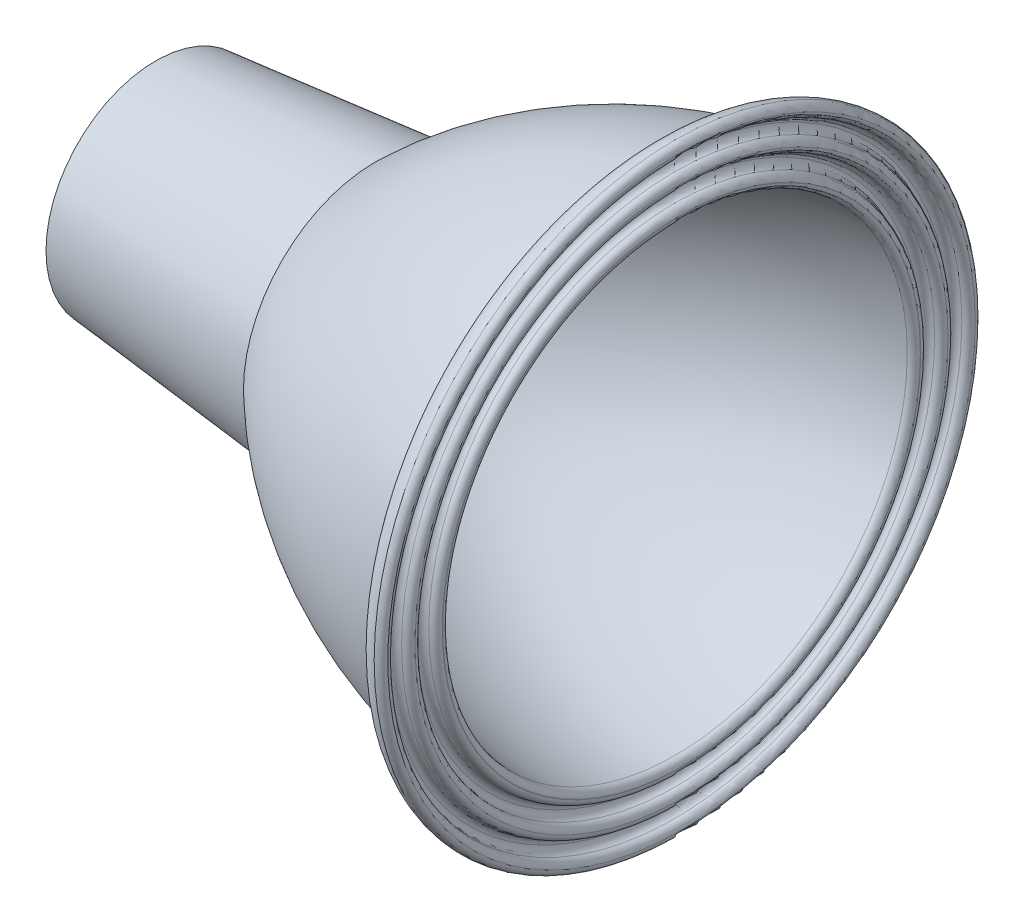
ISO-10303-21;
HEADER;
FILE_DESCRIPTION(('STEP AP214'),'2;1');
FILE_NAME('part.step','',(''),(''),'','','');
FILE_SCHEMA(('AUTOMOTIVE_DESIGN { 1 0 10303 214 1 1 1 1 }'));
ENDSEC;
DATA;
#1=APPLICATION_CONTEXT('core data for automotive mechanical design processes');
#2=APPLICATION_PROTOCOL_DEFINITION('international standard','automotive_design',2000,#1);
#3=PRODUCT_CONTEXT('',#1,'mechanical');
#4=PRODUCT('Part','Part','',(#3));
#5=PRODUCT_RELATED_PRODUCT_CATEGORY('part','',(#4));
#6=PRODUCT_DEFINITION_FORMATION('','',#4);
#7=PRODUCT_DEFINITION_CONTEXT('part definition',#1,'design');
#8=PRODUCT_DEFINITION('design','',#6,#7);
#9=PRODUCT_DEFINITION_SHAPE('','',#8);
#10=(LENGTH_UNIT() NAMED_UNIT(*) SI_UNIT(.MILLI.,.METRE.));
#11=(NAMED_UNIT(*) PLANE_ANGLE_UNIT() SI_UNIT($,.RADIAN.));
#12=(NAMED_UNIT(*) SI_UNIT($,.STERADIAN.) SOLID_ANGLE_UNIT());
#13=UNCERTAINTY_MEASURE_WITH_UNIT(LENGTH_MEASURE(1.E-05),#10,'distance_accuracy_value','');
#14=(GEOMETRIC_REPRESENTATION_CONTEXT(3) GLOBAL_UNCERTAINTY_ASSIGNED_CONTEXT((#13)) GLOBAL_UNIT_ASSIGNED_CONTEXT((#10,
#11,#12)) REPRESENTATION_CONTEXT('',''));
#15=CARTESIAN_POINT('',(0.,0.,0.));
#16=DIRECTION('',(0.,0.,1.));
#17=DIRECTION('',(1.,0.,0.));
#18=AXIS2_PLACEMENT_3D('',#15,#16,#17);
#19=CARTESIAN_POINT('',(25.2463601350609,0.,0.));
#20=DIRECTION('',(-1.,0.,0.));
#21=DIRECTION('',(0.,0.,1.));
#22=AXIS2_PLACEMENT_3D('',#19,#20,#21);
#23=DEGENERATE_TOROIDAL_SURFACE('',#22,9.86028066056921,20.5,.F.);
#24=CARTESIAN_POINT('',(23.6844730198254,0.,0.));
#25=DIRECTION('',(1.,0.,0.));
#26=DIRECTION('',(0.,0.,-1.));
#27=AXIS2_PLACEMENT_3D('',#24,#25,#26);
#28=CIRCLE('',#27,10.5801329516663);
#29=CARTESIAN_POINT('',(23.6844730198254,0.,-10.5801329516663));
#30=VERTEX_POINT('',#29);
#31=EDGE_CURVE('E10',#30,#30,#28,.T.);
#32=ORIENTED_EDGE('',*,*,#31,.T.);
#33=EDGE_LOOP('',(#32));
#34=FACE_BOUND('',#33,.T.);
#35=CARTESIAN_POINT('',(10.6757452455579,0.,0.));
#36=DIRECTION('',(-1.,0.,0.));
#37=DIRECTION('',(0.,0.,1.));
#38=AXIS2_PLACEMENT_3D('',#35,#36,#37);
#39=CIRCLE('',#38,4.56009318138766);
#40=CARTESIAN_POINT('',(10.6757452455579,0.,4.56009318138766));
#41=VERTEX_POINT('',#40);
#42=EDGE_CURVE('E408',#41,#41,#39,.T.);
#43=ORIENTED_EDGE('',*,*,#42,.T.);
#44=EDGE_LOOP('',(#43));
#45=FACE_BOUND('',#44,.T.);
#46=ADVANCED_FACE('F347',(#34,#45),#23,.T.);
#47=CARTESIAN_POINT('',(23.9708542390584,-30.5711970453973,0.));
#48=DIRECTION('',(1.,0.,0.));
#49=DIRECTION('',(0.,0.,-1.));
#50=AXIS2_PLACEMENT_3D('',#47,#48,#49);
#51=PLANE('',#50);
#52=CARTESIAN_POINT('',(23.9708542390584,0.,0.));
#53=DIRECTION('',(1.,0.,0.));
#54=DIRECTION('',(0.,0.,-1.));
#55=AXIS2_PLACEMENT_3D('',#52,#53,#54);
#56=CIRCLE('',#55,10.8892318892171);
#57=CARTESIAN_POINT('',(23.9708542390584,0.,-10.8892318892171));
#58=VERTEX_POINT('',#57);
#59=EDGE_CURVE('E353',#58,#58,#56,.F.);
#60=ORIENTED_EDGE('',*,*,#59,.T.);
#61=EDGE_LOOP('',(#60));
#62=FACE_BOUND('',#61,.T.);
#63=CARTESIAN_POINT('',(23.9708542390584,0.,0.));
#64=DIRECTION('',(1.,0.,0.));
#65=DIRECTION('',(0.,0.,-1.));
#66=AXIS2_PLACEMENT_3D('',#63,#64,#65);
#67=CIRCLE('',#66,10.91);
#68=CARTESIAN_POINT('',(23.9708542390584,0.,-10.91));
#69=VERTEX_POINT('',#68);
#70=EDGE_CURVE('E396',#69,#69,#67,.T.);
#71=ORIENTED_EDGE('',*,*,#70,.T.);
#72=EDGE_LOOP('',(#71));
#73=FACE_BOUND('',#72,.T.);
#74=ADVANCED_FACE('F439',(#62,#73),#51,.T.);
#75=CARTESIAN_POINT('',(23.3708542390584,-30.5711970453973,0.));
#76=DIRECTION('',(1.,0.,0.));
#77=DIRECTION('',(0.,0.,-1.));
#78=AXIS2_PLACEMENT_3D('',#75,#76,#77);
#79=PLANE('',#78);
#80=CARTESIAN_POINT('',(23.3708542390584,0.,0.));
#81=DIRECTION('',(1.,0.,0.));
#82=DIRECTION('',(0.,0.,-1.));
#83=AXIS2_PLACEMENT_3D('',#80,#81,#82);
#84=CIRCLE('',#83,11.5303226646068);
#85=CARTESIAN_POINT('',(23.3708542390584,0.,-11.5303226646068));
#86=VERTEX_POINT('',#85);
#87=EDGE_CURVE('E384',#86,#86,#84,.T.);
#88=ORIENTED_EDGE('',*,*,#87,.T.);
#89=EDGE_LOOP('',(#88));
#90=FACE_BOUND('',#89,.T.);
#91=CARTESIAN_POINT('',(23.3708542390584,0.,0.));
#92=DIRECTION('',(1.,0.,0.));
#93=DIRECTION('',(0.,0.,-1.));
#94=AXIS2_PLACEMENT_3D('',#91,#92,#93);
#95=CIRCLE('',#94,11.5296773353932);
#96=CARTESIAN_POINT('',(23.3708542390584,0.,-11.5296773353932));
#97=VERTEX_POINT('',#96);
#98=EDGE_CURVE('E387',#97,#97,#95,.F.);
#99=ORIENTED_EDGE('',*,*,#98,.T.);
#100=EDGE_LOOP('',(#99));
#101=FACE_BOUND('',#100,.T.);
#102=ADVANCED_FACE('F444',(#90,#101),#79,.T.);
#103=CARTESIAN_POINT('',(23.3708542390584,-30.5711970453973,0.));
#104=DIRECTION('',(1.,0.,0.));
#105=DIRECTION('',(0.,0.,-1.));
#106=AXIS2_PLACEMENT_3D('',#103,#104,#105);
#107=PLANE('',#106);
#108=CARTESIAN_POINT('',(23.3708542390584,0.,0.));
#109=DIRECTION('',(1.,0.,0.));
#110=DIRECTION('',(0.,0.,-1.));
#111=AXIS2_PLACEMENT_3D('',#108,#109,#110);
#112=CIRCLE('',#111,12.7696773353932);
#113=CARTESIAN_POINT('',(23.3708542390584,0.,-12.7696773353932));
#114=VERTEX_POINT('',#113);
#115=EDGE_CURVE('E375',#114,#114,#112,.F.);
#116=ORIENTED_EDGE('',*,*,#115,.T.);
#117=EDGE_LOOP('',(#116));
#118=FACE_BOUND('',#117,.T.);
#119=CARTESIAN_POINT('',(23.3708542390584,0.,0.));
#120=DIRECTION('',(1.,0.,0.));
#121=DIRECTION('',(0.,0.,-1.));
#122=AXIS2_PLACEMENT_3D('',#119,#120,#121);
#123=CIRCLE('',#122,12.7703226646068);
#124=CARTESIAN_POINT('',(23.3708542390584,0.,-12.7703226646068));
#125=VERTEX_POINT('',#124);
#126=EDGE_CURVE('E378',#125,#125,#123,.T.);
#127=ORIENTED_EDGE('',*,*,#126,.T.);
#128=EDGE_LOOP('',(#127));
#129=FACE_BOUND('',#128,.T.);
#130=ADVANCED_FACE('F474',(#118,#129),#107,.T.);
#131=CARTESIAN_POINT('',(22.7708542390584,-30.5711970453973,0.));
#132=DIRECTION('',(-1.,0.,0.));
#133=DIRECTION('',(0.,0.,1.));
#134=AXIS2_PLACEMENT_3D('',#131,#132,#133);
#135=PLANE('',#134);
#136=CARTESIAN_POINT('',(22.7708542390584,0.,0.));
#137=DIRECTION('',(-1.,0.,0.));
#138=DIRECTION('',(0.,0.,1.));
#139=AXIS2_PLACEMENT_3D('',#136,#137,#138);
#140=CIRCLE('',#139,12.1779059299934);
#141=CARTESIAN_POINT('',(22.7708542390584,0.,12.1779059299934));
#142=VERTEX_POINT('',#141);
#143=EDGE_CURVE('E357',#142,#142,#140,.F.);
#144=ORIENTED_EDGE('',*,*,#143,.T.);
#145=EDGE_LOOP('',(#144));
#146=FACE_BOUND('',#145,.T.);
#147=CARTESIAN_POINT('',(22.7708542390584,0.,0.));
#148=DIRECTION('',(-1.,0.,0.));
#149=DIRECTION('',(0.,0.,1.));
#150=AXIS2_PLACEMENT_3D('',#147,#148,#149);
#151=CIRCLE('',#150,12.81);
#152=CARTESIAN_POINT('',(22.7708542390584,0.,12.81));
#153=VERTEX_POINT('',#152);
#154=EDGE_CURVE('E366',#153,#153,#151,.T.);
#155=ORIENTED_EDGE('',*,*,#154,.T.);
#156=EDGE_LOOP('',(#155));
#157=FACE_BOUND('',#156,.T.);
#158=ADVANCED_FACE('F470',(#146,#157),#135,.T.);
#159=CARTESIAN_POINT('',(25.2463601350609,0.,0.));
#160=DIRECTION('',(-1.,0.,0.));
#161=DIRECTION('',(0.,0.,1.));
#162=AXIS2_PLACEMENT_3D('',#159,#160,#161);
#163=DEGENERATE_TOROIDAL_SURFACE('',#162,9.86028066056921,22.,.F.);
#164=CARTESIAN_POINT('',(22.5949578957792,0.,0.));
#165=DIRECTION('',(1.,0.,0.));
#166=DIRECTION('',(0.,0.,-1.));
#167=AXIS2_PLACEMENT_3D('',#164,#165,#166);
#168=CIRCLE('',#167,11.9793637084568);
#169=CARTESIAN_POINT('',(22.5949578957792,0.,-11.9793637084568));
#170=VERTEX_POINT('',#169);
#171=EDGE_CURVE('E361',#170,#170,#168,.F.);
#172=ORIENTED_EDGE('',*,*,#171,.T.);
#173=EDGE_LOOP('',(#172));
#174=FACE_BOUND('',#173,.T.);
#175=CARTESIAN_POINT('',(10.,0.,0.));
#176=DIRECTION('',(-1.,0.,0.));
#177=DIRECTION('',(0.,0.,1.));
#178=AXIS2_PLACEMENT_3D('',#175,#176,#177);
#179=CIRCLE('',#178,5.99999999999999);
#180=CARTESIAN_POINT('',(10.,0.,5.99999999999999));
#181=VERTEX_POINT('',#180);
#182=EDGE_CURVE('E399',#181,#181,#179,.T.);
#183=ORIENTED_EDGE('',*,*,#182,.F.);
#184=EDGE_LOOP('',(#183));
#185=FACE_BOUND('',#184,.T.);
#186=ADVANCED_FACE('F466',(#174,#185),#163,.F.);
#187=CARTESIAN_POINT('',(0.,0.,0.));
#188=DIRECTION('',(1.,0.,0.));
#189=DIRECTION('',(0.,0.,-1.));
#190=AXIS2_PLACEMENT_3D('',#187,#188,#189);
#191=CONICAL_SURFACE('',#190,5.,0.0996686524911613);
#192=ORIENTED_EDGE('',*,*,#182,.T.);
#193=EDGE_LOOP('',(#192));
#194=FACE_BOUND('',#193,.T.);
#195=CARTESIAN_POINT('',(0.,0.,0.));
#196=DIRECTION('',(-1.,0.,0.));
#197=DIRECTION('',(0.,0.,1.));
#198=AXIS2_PLACEMENT_3D('',#195,#196,#197);
#199=CIRCLE('',#198,5.);
#200=CARTESIAN_POINT('',(0.,0.,5.));
#201=VERTEX_POINT('',#200);
#202=EDGE_CURVE('E402',#201,#201,#199,.T.);
#203=ORIENTED_EDGE('',*,*,#202,.F.);
#204=EDGE_LOOP('',(#203));
#205=FACE_BOUND('',#204,.T.);
#206=ADVANCED_FACE('F459',(#194,#205),#191,.T.);
#207=CARTESIAN_POINT('',(0.,-30.5711970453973,0.));
#208=DIRECTION('',(-1.,0.,0.));
#209=DIRECTION('',(0.,0.,1.));
#210=AXIS2_PLACEMENT_3D('',#207,#208,#209);
#211=PLANE('',#210);
#212=ORIENTED_EDGE('',*,*,#202,.T.);
#213=EDGE_LOOP('',(#212));
#214=FACE_BOUND('',#213,.T.);
#215=CARTESIAN_POINT('',(0.,0.,0.));
#216=DIRECTION('',(-1.,0.,0.));
#217=DIRECTION('',(0.,0.,1.));
#218=AXIS2_PLACEMENT_3D('',#215,#216,#217);
#219=CIRCLE('',#218,3.49251865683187);
#220=CARTESIAN_POINT('',(0.,0.,3.49251865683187));
#221=VERTEX_POINT('',#220);
#222=EDGE_CURVE('E405',#221,#221,#219,.T.);
#223=ORIENTED_EDGE('',*,*,#222,.F.);
#224=EDGE_LOOP('',(#223));
#225=FACE_BOUND('',#224,.T.);
#226=ADVANCED_FACE('F450',(#214,#225),#211,.T.);
#227=CARTESIAN_POINT('',(10.6757452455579,0.,0.));
#228=DIRECTION('',(1.,0.,0.));
#229=DIRECTION('',(0.,0.,-1.));
#230=AXIS2_PLACEMENT_3D('',#227,#228,#229);
#231=CONICAL_SURFACE('',#230,4.56009318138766,0.0996686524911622);
#232=ORIENTED_EDGE('',*,*,#222,.T.);
#233=EDGE_LOOP('',(#232));
#234=FACE_BOUND('',#233,.T.);
#235=ORIENTED_EDGE('',*,*,#42,.F.);
#236=EDGE_LOOP('',(#235));
#237=FACE_BOUND('',#236,.T.);
#238=ADVANCED_FACE('F448',(#234,#237),#231,.F.);
#239=CARTESIAN_POINT('',(23.6608542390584,0.,0.));
#240=DIRECTION('',(1.,0.,0.));
#241=DIRECTION('',(0.,0.,-1.));
#242=AXIS2_PLACEMENT_3D('',#239,#240,#241);
#243=TOROIDAL_SURFACE('',#242,10.91,0.31);
#244=CARTESIAN_POINT('',(23.6708542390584,0.,0.));
#245=DIRECTION('',(-1.,0.,0.));
#246=DIRECTION('',(0.,0.,1.));
#247=AXIS2_PLACEMENT_3D('',#244,#245,#246);
#248=CIRCLE('',#247,11.2198386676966);
#249=CARTESIAN_POINT('',(23.6708542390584,0.,11.2198386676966));
#250=VERTEX_POINT('',#249);
#251=EDGE_CURVE('E381',#250,#250,#248,.F.);
#252=ORIENTED_EDGE('',*,*,#251,.T.);
#253=EDGE_LOOP('',(#252));
#254=FACE_BOUND('',#253,.T.);
#255=ORIENTED_EDGE('',*,*,#70,.F.);
#256=EDGE_LOOP('',(#255));
#257=FACE_BOUND('',#256,.T.);
#258=ADVANCED_FACE('F449',(#254,#257),#243,.T.);
#259=CARTESIAN_POINT('',(23.6608542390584,0.,0.));
#260=DIRECTION('',(1.,0.,0.));
#261=DIRECTION('',(0.,0.,-1.));
#262=AXIS2_PLACEMENT_3D('',#259,#260,#261);
#263=TOROIDAL_SURFACE('',#262,12.15,0.31);
#264=CARTESIAN_POINT('',(23.6708542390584,0.,0.));
#265=DIRECTION('',(-1.,0.,0.));
#266=DIRECTION('',(0.,0.,1.));
#267=AXIS2_PLACEMENT_3D('',#264,#265,#266);
#268=CIRCLE('',#267,12.4598386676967);
#269=CARTESIAN_POINT('',(23.6708542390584,0.,12.4598386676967));
#270=VERTEX_POINT('',#269);
#271=EDGE_CURVE('E372',#270,#270,#268,.F.);
#272=ORIENTED_EDGE('',*,*,#271,.T.);
#273=EDGE_LOOP('',(#272));
#274=FACE_BOUND('',#273,.T.);
#275=CARTESIAN_POINT('',(23.9708542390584,0.,0.));
#276=DIRECTION('',(1.,0.,0.));
#277=DIRECTION('',(0.,0.,-1.));
#278=AXIS2_PLACEMENT_3D('',#275,#276,#277);
#279=CIRCLE('',#278,12.15);
#280=CARTESIAN_POINT('',(23.9708542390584,0.,-12.15));
#281=VERTEX_POINT('',#280);
#282=EDGE_CURVE('E411',#281,#281,#279,.T.);
#283=ORIENTED_EDGE('',*,*,#282,.F.);
#284=EDGE_LOOP('',(#283));
#285=FACE_BOUND('',#284,.T.);
#286=ADVANCED_FACE('F434',(#274,#285),#263,.T.);
#287=CARTESIAN_POINT('',(23.6608542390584,0.,0.));
#288=DIRECTION('',(1.,0.,0.));
#289=DIRECTION('',(0.,0.,-1.));
#290=AXIS2_PLACEMENT_3D('',#287,#288,#289);
#291=TOROIDAL_SURFACE('',#290,12.15,0.31);
#292=CARTESIAN_POINT('',(23.6708542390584,0.,0.));
#293=DIRECTION('',(-1.,0.,0.));
#294=DIRECTION('',(0.,0.,1.));
#295=AXIS2_PLACEMENT_3D('',#292,#293,#294);
#296=CIRCLE('',#295,11.8401613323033);
#297=CARTESIAN_POINT('',(23.6708542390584,0.,11.8401613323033));
#298=VERTEX_POINT('',#297);
#299=EDGE_CURVE('E390',#298,#298,#296,.T.);
#300=ORIENTED_EDGE('',*,*,#299,.T.);
#301=EDGE_LOOP('',(#300));
#302=FACE_BOUND('',#301,.T.);
#303=ORIENTED_EDGE('',*,*,#282,.T.);
#304=EDGE_LOOP('',(#303));
#305=FACE_BOUND('',#304,.T.);
#306=ADVANCED_FACE('F422',(#302,#305),#291,.T.);
#307=CARTESIAN_POINT('',(23.6608542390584,0.,0.));
#308=DIRECTION('',(1.,0.,0.));
#309=DIRECTION('',(0.,0.,-1.));
#310=AXIS2_PLACEMENT_3D('',#307,#308,#309);
#311=TOROIDAL_SURFACE('',#310,13.39,0.31);
#312=CARTESIAN_POINT('',(23.6608542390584,0.,0.));
#313=DIRECTION('',(1.,0.,0.));
#314=DIRECTION('',(0.,0.,-1.));
#315=AXIS2_PLACEMENT_3D('',#312,#313,#314);
#316=CIRCLE('',#315,13.7);
#317=CARTESIAN_POINT('',(23.6608542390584,0.,-13.7));
#318=VERTEX_POINT('',#317);
#319=EDGE_CURVE('E393',#318,#318,#316,.F.);
#320=ORIENTED_EDGE('',*,*,#319,.F.);
#321=EDGE_LOOP('',(#320));
#322=FACE_BOUND('',#321,.T.);
#323=CARTESIAN_POINT('',(23.9708542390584,0.,0.));
#324=DIRECTION('',(1.,0.,0.));
#325=DIRECTION('',(0.,0.,-1.));
#326=AXIS2_PLACEMENT_3D('',#323,#324,#325);
#327=CIRCLE('',#326,13.39);
#328=CARTESIAN_POINT('',(23.9708542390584,0.,-13.39));
#329=VERTEX_POINT('',#328);
#330=EDGE_CURVE('E414',#329,#329,#327,.T.);
#331=ORIENTED_EDGE('',*,*,#330,.F.);
#332=EDGE_LOOP('',(#331));
#333=FACE_BOUND('',#332,.T.);
#334=ADVANCED_FACE('F420',(#322,#333),#311,.T.);
#335=CARTESIAN_POINT('',(23.6608542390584,0.,0.));
#336=DIRECTION('',(1.,0.,0.));
#337=DIRECTION('',(0.,0.,-1.));
#338=AXIS2_PLACEMENT_3D('',#335,#336,#337);
#339=TOROIDAL_SURFACE('',#338,13.39,0.31);
#340=CARTESIAN_POINT('',(23.6708542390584,0.,0.));
#341=DIRECTION('',(-1.,0.,0.));
#342=DIRECTION('',(0.,0.,1.));
#343=AXIS2_PLACEMENT_3D('',#340,#341,#342);
#344=CIRCLE('',#343,13.0801613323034);
#345=CARTESIAN_POINT('',(23.6708542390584,0.,13.0801613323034));
#346=VERTEX_POINT('',#345);
#347=EDGE_CURVE('E369',#346,#346,#344,.T.);
#348=ORIENTED_EDGE('',*,*,#347,.T.);
#349=EDGE_LOOP('',(#348));
#350=FACE_BOUND('',#349,.T.);
#351=ORIENTED_EDGE('',*,*,#330,.T.);
#352=EDGE_LOOP('',(#351));
#353=FACE_BOUND('',#352,.T.);
#354=ADVANCED_FACE('F418',(#350,#353),#339,.T.);
#355=CARTESIAN_POINT('',(23.6808542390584,0.,0.));
#356=DIRECTION('',(-1.,0.,0.));
#357=DIRECTION('',(0.,0.,1.));
#358=AXIS2_PLACEMENT_3D('',#355,#356,#357);
#359=TOROIDAL_SURFACE('',#358,11.5303226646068,0.31);
#360=ORIENTED_EDGE('',*,*,#87,.F.);
#361=EDGE_LOOP('',(#360));
#362=FACE_BOUND('',#361,.T.);
#363=ORIENTED_EDGE('',*,*,#299,.F.);
#364=EDGE_LOOP('',(#363));
#365=FACE_BOUND('',#364,.T.);
#366=ADVANCED_FACE('F430',(#362,#365),#359,.F.);
#367=CARTESIAN_POINT('',(23.6808542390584,0.,0.));
#368=DIRECTION('',(1.,0.,0.));
#369=DIRECTION('',(0.,0.,-1.));
#370=AXIS2_PLACEMENT_3D('',#367,#368,#369);
#371=TOROIDAL_SURFACE('',#370,11.5296773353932,0.31);
#372=ORIENTED_EDGE('',*,*,#251,.F.);
#373=EDGE_LOOP('',(#372));
#374=FACE_BOUND('',#373,.T.);
#375=ORIENTED_EDGE('',*,*,#98,.F.);
#376=EDGE_LOOP('',(#375));
#377=FACE_BOUND('',#376,.T.);
#378=ADVANCED_FACE('F486',(#374,#377),#371,.F.);
#379=CARTESIAN_POINT('',(23.6808542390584,0.,0.));
#380=DIRECTION('',(1.,0.,0.));
#381=DIRECTION('',(0.,0.,-1.));
#382=AXIS2_PLACEMENT_3D('',#379,#380,#381);
#383=TOROIDAL_SURFACE('',#382,12.7696773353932,0.31);
#384=ORIENTED_EDGE('',*,*,#271,.F.);
#385=EDGE_LOOP('',(#384));
#386=FACE_BOUND('',#385,.T.);
#387=ORIENTED_EDGE('',*,*,#115,.F.);
#388=EDGE_LOOP('',(#387));
#389=FACE_BOUND('',#388,.T.);
#390=ADVANCED_FACE('F488',(#386,#389),#383,.F.);
#391=CARTESIAN_POINT('',(23.6808542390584,0.,0.));
#392=DIRECTION('',(-1.,0.,0.));
#393=DIRECTION('',(0.,0.,1.));
#394=AXIS2_PLACEMENT_3D('',#391,#392,#393);
#395=TOROIDAL_SURFACE('',#394,12.7703226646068,0.31);
#396=ORIENTED_EDGE('',*,*,#126,.F.);
#397=EDGE_LOOP('',(#396));
#398=FACE_BOUND('',#397,.T.);
#399=ORIENTED_EDGE('',*,*,#347,.F.);
#400=EDGE_LOOP('',(#399));
#401=FACE_BOUND('',#400,.T.);
#402=ADVANCED_FACE('F495',(#398,#401),#395,.F.);
#403=CARTESIAN_POINT('',(23.6608542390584,0.,0.));
#404=DIRECTION('',(-1.,0.,0.));
#405=DIRECTION('',(0.,0.,1.));
#406=AXIS2_PLACEMENT_3D('',#403,#404,#405);
#407=TOROIDAL_SURFACE('',#406,12.81,0.89);
#408=ORIENTED_EDGE('',*,*,#319,.T.);
#409=EDGE_LOOP('',(#408));
#410=FACE_BOUND('',#409,.T.);
#411=ORIENTED_EDGE('',*,*,#154,.F.);
#412=EDGE_LOOP('',(#411));
#413=FACE_BOUND('',#412,.T.);
#414=ADVANCED_FACE('F504',(#410,#413),#407,.T.);
#415=CARTESIAN_POINT('',(22.5708542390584,0.,0.));
#416=DIRECTION('',(-1.,0.,0.));
#417=DIRECTION('',(0.,0.,1.));
#418=AXIS2_PLACEMENT_3D('',#415,#416,#417);
#419=TOROIDAL_SURFACE('',#418,12.1779059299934,0.2);
#420=ORIENTED_EDGE('',*,*,#143,.F.);
#421=EDGE_LOOP('',(#420));
#422=FACE_BOUND('',#421,.T.);
#423=ORIENTED_EDGE('',*,*,#171,.F.);
#424=EDGE_LOOP('',(#423));
#425=FACE_BOUND('',#424,.T.);
#426=ADVANCED_FACE('F508',(#422,#425),#419,.F.);
#427=CARTESIAN_POINT('',(23.6608542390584,0.,0.));
#428=DIRECTION('',(1.,0.,0.));
#429=DIRECTION('',(0.,0.,-1.));
#430=AXIS2_PLACEMENT_3D('',#427,#428,#429);
#431=TOROIDAL_SURFACE('',#430,10.8892318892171,0.31);
#432=ORIENTED_EDGE('',*,*,#31,.F.);
#433=EDGE_LOOP('',(#432));
#434=FACE_BOUND('',#433,.T.);
#435=ORIENTED_EDGE('',*,*,#59,.F.);
#436=EDGE_LOOP('',(#435));
#437=FACE_BOUND('',#436,.T.);
#438=ADVANCED_FACE('F511',(#434,#437),#431,.T.);
#439=CLOSED_SHELL('',(#46,#74,#102,#130,#158,#186,#206,#226,#238,#258,#286,#306,#334,#354,#366,
#378,#390,#402,#414,#426,#438));
#440=MANIFOLD_SOLID_BREP('B2',#439);
#441=ADVANCED_BREP_SHAPE_REPRESENTATION('',(#18,#440),#14);
#442=SHAPE_DEFINITION_REPRESENTATION(#9,#441);
ENDSEC;
END-ISO-10303-21;
